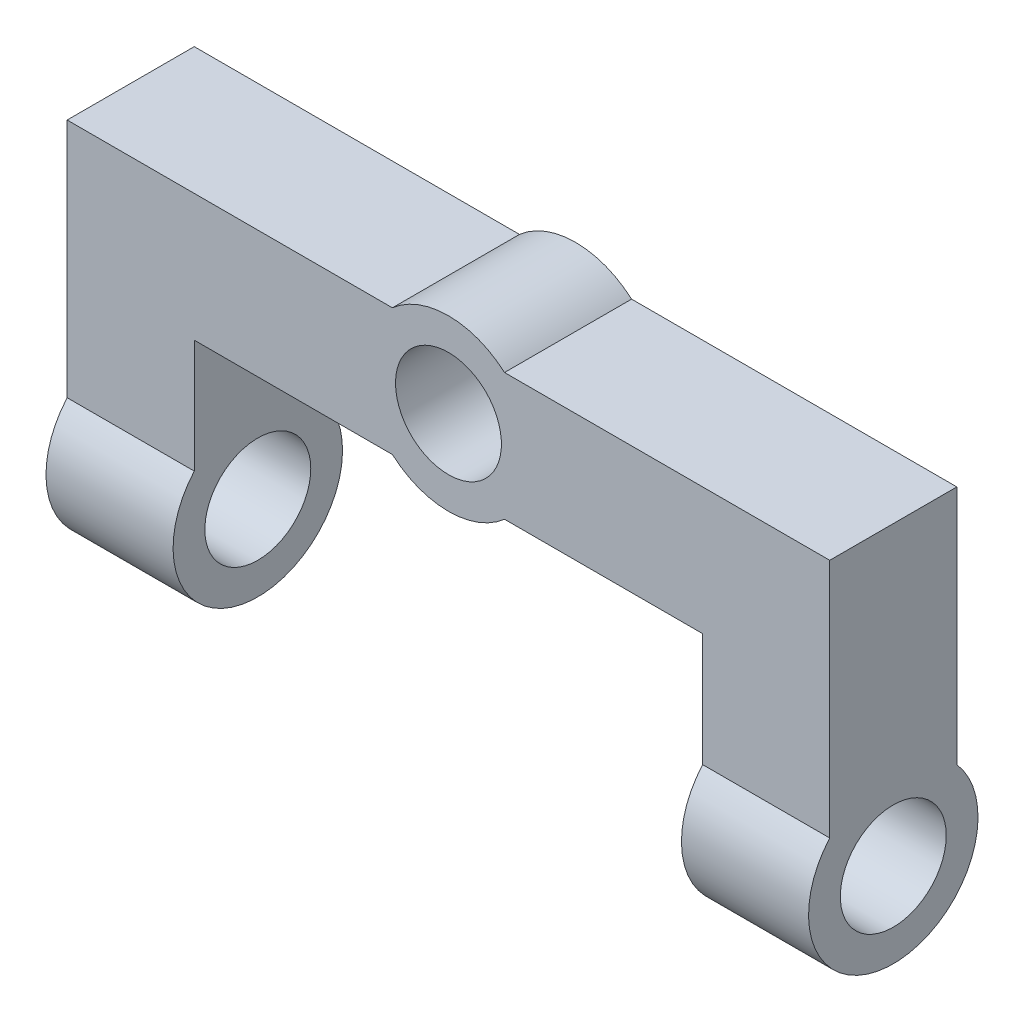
from build123d import *

# Parameters (mm, degrees)
EXTRUSION1_DEPTH        = 6
ESQUISSE2_R             = 4
EXTRUSION2_DEPTH        = 6
EXTRUSION3_START        = -6
ESQUISSE3_R             = 4
EXTRUSION3_DEPTH        = 6
ESQUISSE4_R             = 4
EXTRUSION4_DEPTH        = 6
ESQUISSE5_R             = 2.5
ENL_V_MAT_EXTRU_1_DEPTH = 40.623225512
ESQUISSE6_R             = 2.5
ENL_V_MAT_EXTRU_2_DEPTH = 40.623225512


with BuildPart() as part:
    # Esquisse1 → Extrusion1 (new body)
    with BuildSketch(Plane.XY):
        Polygon((0, 0), (0, 14), (36, 14), (36, 0), (30, 0), (30, 8), (6, 8), (6, 0), align=None)
    extrude(amount=EXTRUSION1_DEPTH)

    # Esquisse2 → Extrusion2 (add)
    with BuildSketch(Plane(origin=(36, 0, 0), x_dir=(0, 0, -1), z_dir=(1, 0, 0))):
        with Locations((-3, 0)):
            Circle(ESQUISSE2_R)
    extrude(amount=-EXTRUSION2_DEPTH)

    # Esquisse3 → Extrusion3 (add)
    with BuildSketch(Plane.ZY.offset(EXTRUSION3_START)):
        with Locations((3, 0)):
            Circle(ESQUISSE3_R)
    extrude(amount=EXTRUSION3_DEPTH)

    # Esquisse4 → Extrusion4 (add)
    with BuildSketch(Plane(origin=(0, 0, 0), x_dir=(-1, 0, 0), z_dir=(0, 0, -1))):
        with Locations((-18, 11)):
            Circle(ESQUISSE4_R)
    extrude(amount=-EXTRUSION4_DEPTH)

    # Esquisse5 → Enl_v. mat.-Extru.1 (cut, through all)
    with BuildSketch(Plane(origin=(0, 0, 0), x_dir=(-1, 0, 0), z_dir=(0, 0, -1))):
        with Locations((-18, 11)):
            Circle(ESQUISSE5_R)
    extrude(amount=-ENL_V_MAT_EXTRU_1_DEPTH, mode=Mode.SUBTRACT)

    # Esquisse6 → Enl_v. mat.-Extru.2 (cut, through all)
    with BuildSketch(Plane(origin=(36, 0, 0), x_dir=(0, 0, -1), z_dir=(1, 0, 0))):
        with Locations((-3, 0)):
            Circle(ESQUISSE6_R)
    extrude(amount=-ENL_V_MAT_EXTRU_2_DEPTH, mode=Mode.SUBTRACT)


solid = part.part
